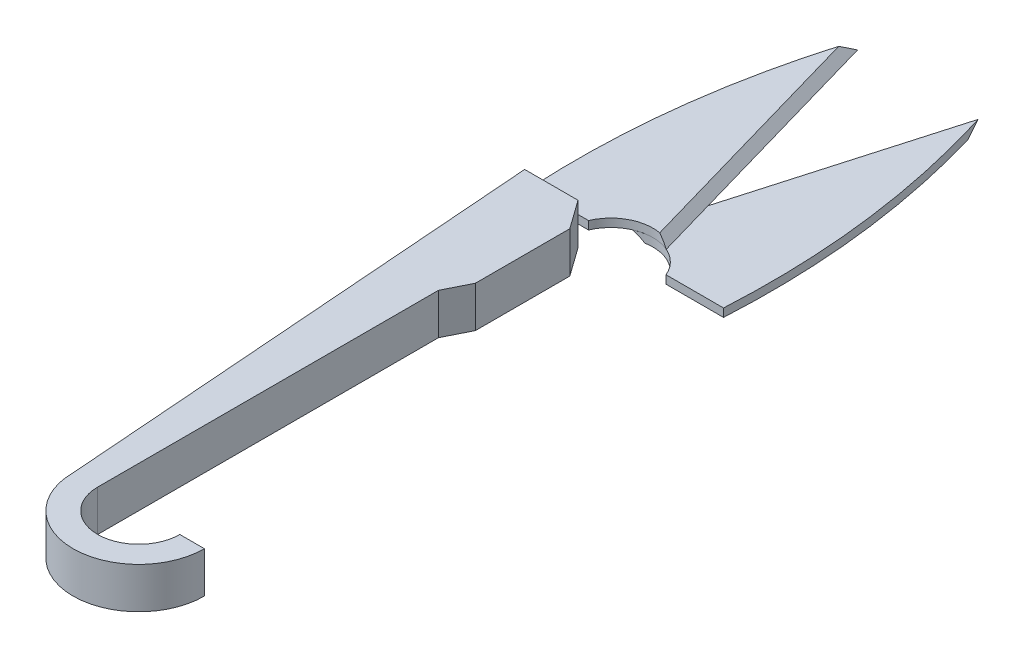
ISO-10303-21;
HEADER;
FILE_DESCRIPTION(('STEP AP214'),'2;1');
FILE_NAME('part.step','',(''),(''),'','','');
FILE_SCHEMA(('AUTOMOTIVE_DESIGN { 1 0 10303 214 1 1 1 1 }'));
ENDSEC;
DATA;
#1=APPLICATION_CONTEXT('core data for automotive mechanical design processes');
#2=APPLICATION_PROTOCOL_DEFINITION('international standard','automotive_design',2000,#1);
#3=PRODUCT_CONTEXT('',#1,'mechanical');
#4=PRODUCT('Part','Part','',(#3));
#5=PRODUCT_RELATED_PRODUCT_CATEGORY('part','',(#4));
#6=PRODUCT_DEFINITION_FORMATION('','',#4);
#7=PRODUCT_DEFINITION_CONTEXT('part definition',#1,'design');
#8=PRODUCT_DEFINITION('design','',#6,#7);
#9=PRODUCT_DEFINITION_SHAPE('','',#8);
#10=(LENGTH_UNIT() NAMED_UNIT(*) SI_UNIT(.MILLI.,.METRE.));
#11=(NAMED_UNIT(*) PLANE_ANGLE_UNIT() SI_UNIT($,.RADIAN.));
#12=(NAMED_UNIT(*) SI_UNIT($,.STERADIAN.) SOLID_ANGLE_UNIT());
#13=UNCERTAINTY_MEASURE_WITH_UNIT(LENGTH_MEASURE(1.E-05),#10,'distance_accuracy_value','');
#14=(GEOMETRIC_REPRESENTATION_CONTEXT(3) GLOBAL_UNCERTAINTY_ASSIGNED_CONTEXT((#13)) GLOBAL_UNIT_ASSIGNED_CONTEXT((#10,
#11,#12)) REPRESENTATION_CONTEXT('',''));
#15=CARTESIAN_POINT('',(0.,0.,0.));
#16=DIRECTION('',(0.,0.,1.));
#17=DIRECTION('',(1.,0.,0.));
#18=AXIS2_PLACEMENT_3D('',#15,#16,#17);
#19=CARTESIAN_POINT('',(0.,-1.,-15.));
#20=DIRECTION('',(0.,0.,-1.));
#21=DIRECTION('',(-1.,0.,0.));
#22=AXIS2_PLACEMENT_3D('',#19,#20,#21);
#23=PLANE('',#22);
#24=DIRECTION('',(-1.,0.,0.));
#25=VECTOR('',#24,1.);
#26=CARTESIAN_POINT('',(0.,0.,-15.));
#27=LINE('',#26,#25);
#28=CARTESIAN_POINT('',(11.7186421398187,0.,-15.));
#29=VERTEX_POINT('',#28);
#30=CARTESIAN_POINT('',(4.71864213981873,0.,-15.));
#31=VERTEX_POINT('',#30);
#32=EDGE_CURVE('E150',#29,#31,#27,.T.);
#33=ORIENTED_EDGE('',*,*,#32,.T.);
#34=DIRECTION('',(0.,1.,0.));
#35=VECTOR('',#34,1.);
#36=CARTESIAN_POINT('',(4.71864213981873,-1.,-15.));
#37=LINE('',#36,#35);
#38=CARTESIAN_POINT('',(4.71864213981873,-1.,-15.));
#39=VERTEX_POINT('',#38);
#40=EDGE_CURVE('E112',#39,#31,#37,.T.);
#41=ORIENTED_EDGE('',*,*,#40,.F.);
#42=DIRECTION('',(-1.,0.,0.));
#43=VECTOR('',#42,1.);
#44=CARTESIAN_POINT('',(0.,-1.,-15.));
#45=LINE('',#44,#43);
#46=CARTESIAN_POINT('',(11.7186421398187,-1.,-15.));
#47=VERTEX_POINT('',#46);
#48=EDGE_CURVE('E117',#47,#39,#45,.T.);
#49=ORIENTED_EDGE('',*,*,#48,.F.);
#50=DIRECTION('',(0.,1.,0.));
#51=VECTOR('',#50,1.);
#52=CARTESIAN_POINT('',(11.7186421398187,-1.,-15.));
#53=LINE('',#52,#51);
#54=EDGE_CURVE('E102',#47,#29,#53,.T.);
#55=ORIENTED_EDGE('',*,*,#54,.T.);
#56=EDGE_LOOP('',(#33,#41,#49,#55));
#57=FACE_BOUND('',#56,.T.);
#58=ADVANCED_FACE('F56',(#57),#23,.F.);
#59=CARTESIAN_POINT('',(0.,-1.,-13.));
#60=DIRECTION('',(0.,1.,0.));
#61=DIRECTION('',(0.,0.,1.));
#62=AXIS2_PLACEMENT_3D('',#59,#60,#61);
#63=CYLINDRICAL_SURFACE('',#62,5.1249959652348);
#64=CARTESIAN_POINT('',(0.,0.,-13.));
#65=DIRECTION('',(0.,1.,0.));
#66=DIRECTION('',(0.,0.,1.));
#67=AXIS2_PLACEMENT_3D('',#64,#65,#66);
#68=CIRCLE('',#67,5.1249959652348);
#69=CARTESIAN_POINT('',(-2.04821488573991,0.,-17.6979143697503));
#70=VERTEX_POINT('',#69);
#71=EDGE_CURVE('E119',#31,#70,#68,.T.);
#72=ORIENTED_EDGE('',*,*,#71,.T.);
#73=CARTESIAN_POINT('',(0.,-3.26458401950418,-13.));
#74=DIRECTION('',(-0.67967554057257,-0.707106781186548,-0.195041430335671));
#75=DIRECTION('',(-0.679675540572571,0.707106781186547,-0.195041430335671));
#76=AXIS2_PLACEMENT_3D('',#73,#74,#75);
#77=ELLIPSE('',#76,7.24783880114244,5.1249959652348);
#78=CARTESIAN_POINT('',(-0.908595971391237,-1.,-18.0438117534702));
#79=VERTEX_POINT('',#78);
#80=EDGE_CURVE('E85',#70,#79,#77,.T.);
#81=ORIENTED_EDGE('',*,*,#80,.T.);
#82=CARTESIAN_POINT('',(0.,-1.,-13.));
#83=DIRECTION('',(0.,1.,0.));
#84=DIRECTION('',(0.,0.,1.));
#85=AXIS2_PLACEMENT_3D('',#82,#83,#84);
#86=CIRCLE('',#85,5.1249959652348);
#87=EDGE_CURVE('E113',#39,#79,#86,.T.);
#88=ORIENTED_EDGE('',*,*,#87,.F.);
#89=ORIENTED_EDGE('',*,*,#40,.T.);
#90=EDGE_LOOP('',(#72,#81,#88,#89));
#91=FACE_BOUND('',#90,.T.);
#92=ADVANCED_FACE('F134',(#91),#63,.F.);
#93=CARTESIAN_POINT('',(11.7186421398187,-1.,-15.));
#94=CARTESIAN_POINT('',(12.7251725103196,-1.,-33.0616488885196));
#95=CARTESIAN_POINT('',(7.33022859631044,-1.,-50.3796816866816));
#96=B_SPLINE_CURVE_WITH_KNOTS('',2,(#93,#94,#95),.UNSPECIFIED.,.F.,.F.,(3,3),(0.,1.),.UNSPECIFIED.);
#97=DIRECTION('',(0.,1.,0.));
#98=VECTOR('',#97,1.);
#99=SURFACE_OF_LINEAR_EXTRUSION('',#96,#98);
#100=CARTESIAN_POINT('',(7.86349357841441,-1.,-48.6125719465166));
#101=VERTEX_POINT('',#100);
#102=EDGE_CURVE('E105',#47,#101,#96,.T.);
#103=ORIENTED_EDGE('',*,*,#102,.T.);
#104=CARTESIAN_POINT('',(7.86349358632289,-1.,-48.6125719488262));
#105=CARTESIAN_POINT('',(7.77696561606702,-0.835117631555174,-48.908808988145));
#106=CARTESIAN_POINT('',(7.68926288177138,-0.669343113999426,-49.2041866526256));
#107=CARTESIAN_POINT('',(7.51150788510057,-0.33600978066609,-49.7932232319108));
#108=CARTESIAN_POINT('',(7.42145562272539,-0.168450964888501,-50.0868821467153));
#109=CARTESIAN_POINT('',(7.33022859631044,0.,-50.3796816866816));
#110=B_SPLINE_CURVE_WITH_KNOTS('',3,(#104,#105,#106,#107,#108,#109),.UNSPECIFIED.,.F.,.F.,(4,2,
4),(0.,1.04966105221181,2.09932210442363),.UNSPECIFIED.);
#111=CARTESIAN_POINT('',(7.33022859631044,0.,-50.3796816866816));
#112=VERTEX_POINT('',#111);
#113=EDGE_CURVE('E12',#101,#112,#110,.T.);
#114=ORIENTED_EDGE('',*,*,#113,.T.);
#115=CARTESIAN_POINT('',(11.7186421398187,0.,-15.));
#116=CARTESIAN_POINT('',(12.7251725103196,0.,-33.0616488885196));
#117=CARTESIAN_POINT('',(7.33022859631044,0.,-50.3796816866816));
#118=B_SPLINE_CURVE_WITH_KNOTS('',2,(#115,#116,#117),.UNSPECIFIED.,.F.,.F.,(3,3),(0.,1.),.UNSPECIFIED.);
#119=EDGE_CURVE('E108',#29,#112,#118,.T.);
#120=ORIENTED_EDGE('',*,*,#119,.F.);
#121=ORIENTED_EDGE('',*,*,#54,.F.);
#122=EDGE_LOOP('',(#103,#114,#120,#121));
#123=FACE_BOUND('',#122,.T.);
#124=ADVANCED_FACE('F104',(#123),#99,.T.);
#125=CARTESIAN_POINT('',(0.,-1.,0.));
#126=DIRECTION('',(0.,1.,0.));
#127=DIRECTION('',(0.,0.,1.));
#128=AXIS2_PLACEMENT_3D('',#125,#126,#127);
#129=PLANE('',#128);
#130=ORIENTED_EDGE('',*,*,#87,.T.);
#131=DIRECTION('',(0.275830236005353,0.,-0.961206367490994));
#132=VECTOR('',#131,1.);
#133=CARTESIAN_POINT('',(8.29143496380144,-1.,-50.1038514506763));
#134=LINE('',#133,#132);
#135=EDGE_CURVE('E71',#79,#101,#134,.T.);
#136=ORIENTED_EDGE('',*,*,#135,.T.);
#137=ORIENTED_EDGE('',*,*,#102,.F.);
#138=ORIENTED_EDGE('',*,*,#48,.T.);
#139=EDGE_LOOP('',(#130,#136,#137,#138));
#140=FACE_BOUND('',#139,.T.);
#141=ADVANCED_FACE('F121',(#140),#129,.F.);
#142=CARTESIAN_POINT('',(0.,0.,0.));
#143=DIRECTION('',(0.,1.,0.));
#144=DIRECTION('',(0.,0.,1.));
#145=AXIS2_PLACEMENT_3D('',#142,#143,#144);
#146=PLANE('',#145);
#147=ORIENTED_EDGE('',*,*,#32,.F.);
#148=ORIENTED_EDGE('',*,*,#119,.T.);
#149=DIRECTION('',(-0.275830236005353,0.,0.961206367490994));
#150=VECTOR('',#149,1.);
#151=CARTESIAN_POINT('',(-6.58462607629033,0.,-1.88954112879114));
#152=LINE('',#151,#150);
#153=EDGE_CURVE('E144',#112,#70,#152,.T.);
#154=ORIENTED_EDGE('',*,*,#153,.T.);
#155=ORIENTED_EDGE('',*,*,#71,.F.);
#156=EDGE_LOOP('',(#147,#148,#154,#155));
#157=FACE_BOUND('',#156,.T.);
#158=ADVANCED_FACE('F147',(#157),#146,.T.);
#159=CARTESIAN_POINT('',(-6.58462607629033,0.,-1.88954112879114));
#160=DIRECTION('',(-0.67967554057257,-0.707106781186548,-0.195041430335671));
#161=DIRECTION('',(0.275830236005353,0.,-0.961206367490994));
#162=AXIS2_PLACEMENT_3D('',#159,#160,#161);
#163=PLANE('',#162);
#164=ORIENTED_EDGE('',*,*,#113,.F.);
#165=ORIENTED_EDGE('',*,*,#135,.F.);
#166=ORIENTED_EDGE('',*,*,#80,.F.);
#167=ORIENTED_EDGE('',*,*,#153,.F.);
#168=EDGE_LOOP('',(#164,#165,#166,#167));
#169=FACE_BOUND('',#168,.T.);
#170=ADVANCED_FACE('F59',(#169),#163,.T.);
#171=CLOSED_SHELL('',(#58,#92,#124,#141,#158,#170));
#172=MANIFOLD_SOLID_BREP('B2_NOT_SHOWN',#171);
#173=CARTESIAN_POINT('',(-11.7186421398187,1.,-15.));
#174=CARTESIAN_POINT('',(-12.7251725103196,1.,-33.0616488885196));
#175=CARTESIAN_POINT('',(-7.33022859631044,1.,-50.3796816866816));
#176=B_SPLINE_CURVE_WITH_KNOTS('',2,(#173,#174,#175),.UNSPECIFIED.,.F.,.F.,(3,3),(0.,1.),.UNSPECIFIED.);
#177=DIRECTION('',(0.,-1.,0.));
#178=VECTOR('',#177,1.);
#179=SURFACE_OF_LINEAR_EXTRUSION('',#176,#178);
#180=CARTESIAN_POINT('',(-11.7186421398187,1.,-15.));
#181=VERTEX_POINT('',#180);
#182=CARTESIAN_POINT('',(-7.86349357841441,1.,-48.6125719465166));
#183=VERTEX_POINT('',#182);
#184=EDGE_CURVE('E262',#181,#183,#176,.T.);
#185=ORIENTED_EDGE('',*,*,#184,.T.);
#186=CARTESIAN_POINT('',(-7.86349358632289,1.,-48.6125719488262));
#187=CARTESIAN_POINT('',(-7.77696561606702,0.835117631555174,-48.908808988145));
#188=CARTESIAN_POINT('',(-7.68926288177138,0.669343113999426,-49.2041866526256));
#189=CARTESIAN_POINT('',(-7.51150788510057,0.33600978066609,-49.7932232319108));
#190=CARTESIAN_POINT('',(-7.42145562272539,0.168450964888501,-50.0868821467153));
#191=CARTESIAN_POINT('',(-7.33022859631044,0.,-50.3796816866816));
#192=B_SPLINE_CURVE_WITH_KNOTS('',3,(#186,#187,#188,#189,#190,#191),.UNSPECIFIED.,.F.,.F.,(4,2,
4),(0.,1.04966105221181,2.09932210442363),.UNSPECIFIED.);
#193=CARTESIAN_POINT('',(-7.33022859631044,0.,-50.3796816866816));
#194=VERTEX_POINT('',#193);
#195=EDGE_CURVE('E54',#183,#194,#192,.T.);
#196=ORIENTED_EDGE('',*,*,#195,.T.);
#197=CARTESIAN_POINT('',(-11.7186421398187,0.,-15.));
#198=CARTESIAN_POINT('',(-12.7251725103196,0.,-33.0616488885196));
#199=CARTESIAN_POINT('',(-7.33022859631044,0.,-50.3796816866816));
#200=B_SPLINE_CURVE_WITH_KNOTS('',2,(#197,#198,#199),.UNSPECIFIED.,.F.,.F.,(3,3),(0.,1.),.UNSPECIFIED.);
#201=CARTESIAN_POINT('',(-11.7186421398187,0.,-15.));
#202=VERTEX_POINT('',#201);
#203=EDGE_CURVE('E265',#202,#194,#200,.T.);
#204=ORIENTED_EDGE('',*,*,#203,.F.);
#205=DIRECTION('',(0.,-1.,0.));
#206=VECTOR('',#205,1.);
#207=CARTESIAN_POINT('',(-11.7186421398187,1.,-15.));
#208=LINE('',#207,#206);
#209=EDGE_CURVE('E260',#181,#202,#208,.T.);
#210=ORIENTED_EDGE('',*,*,#209,.F.);
#211=EDGE_LOOP('',(#185,#196,#204,#210));
#212=FACE_BOUND('',#211,.T.);
#213=ADVANCED_FACE('F215',(#212),#179,.T.);
#214=CARTESIAN_POINT('',(0.,1.,-15.));
#215=DIRECTION('',(0.,0.,-1.));
#216=DIRECTION('',(-1.,0.,0.));
#217=AXIS2_PLACEMENT_3D('',#214,#215,#216);
#218=PLANE('',#217);
#219=DIRECTION('',(1.,0.,0.));
#220=VECTOR('',#219,1.);
#221=CARTESIAN_POINT('',(0.,0.,-15.));
#222=LINE('',#221,#220);
#223=CARTESIAN_POINT('',(-4.71864213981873,0.,-15.));
#224=VERTEX_POINT('',#223);
#225=EDGE_CURVE('E349',#202,#224,#222,.T.);
#226=ORIENTED_EDGE('',*,*,#225,.T.);
#227=DIRECTION('',(0.,-1.,0.));
#228=VECTOR('',#227,1.);
#229=CARTESIAN_POINT('',(-4.71864213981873,1.,-15.));
#230=LINE('',#229,#228);
#231=CARTESIAN_POINT('',(-4.71864213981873,1.,-15.));
#232=VERTEX_POINT('',#231);
#233=EDGE_CURVE('E269',#232,#224,#230,.T.);
#234=ORIENTED_EDGE('',*,*,#233,.F.);
#235=DIRECTION('',(1.,0.,0.));
#236=VECTOR('',#235,1.);
#237=CARTESIAN_POINT('',(0.,1.,-15.));
#238=LINE('',#237,#236);
#239=EDGE_CURVE('E273',#181,#232,#238,.T.);
#240=ORIENTED_EDGE('',*,*,#239,.F.);
#241=ORIENTED_EDGE('',*,*,#209,.T.);
#242=EDGE_LOOP('',(#226,#234,#240,#241));
#243=FACE_BOUND('',#242,.T.);
#244=ADVANCED_FACE('F274',(#243),#218,.F.);
#245=CARTESIAN_POINT('',(0.,1.,-13.));
#246=DIRECTION('',(0.,-1.,0.));
#247=DIRECTION('',(0.,0.,-1.));
#248=AXIS2_PLACEMENT_3D('',#245,#246,#247);
#249=CYLINDRICAL_SURFACE('',#248,5.1249959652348);
#250=CARTESIAN_POINT('',(0.,0.,-13.));
#251=DIRECTION('',(0.,1.,0.));
#252=DIRECTION('',(0.,0.,1.));
#253=AXIS2_PLACEMENT_3D('',#250,#251,#252);
#254=CIRCLE('',#253,5.1249959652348);
#255=CARTESIAN_POINT('',(2.04821488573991,0.,-17.6979143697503));
#256=VERTEX_POINT('',#255);
#257=EDGE_CURVE('E281',#256,#224,#254,.T.);
#258=ORIENTED_EDGE('',*,*,#257,.F.);
#259=CARTESIAN_POINT('',(0.,3.2645840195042,-13.));
#260=DIRECTION('',(-0.67967554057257,-0.707106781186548,0.195041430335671));
#261=DIRECTION('',(0.679675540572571,-0.707106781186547,-0.195041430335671));
#262=AXIS2_PLACEMENT_3D('',#259,#260,#261);
#263=ELLIPSE('',#262,7.24783880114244,5.1249959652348);
#264=CARTESIAN_POINT('',(0.90859597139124,1.,-18.0438117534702));
#265=VERTEX_POINT('',#264);
#266=EDGE_CURVE('E243',#256,#265,#263,.F.);
#267=ORIENTED_EDGE('',*,*,#266,.T.);
#268=CARTESIAN_POINT('',(0.,1.,-13.));
#269=DIRECTION('',(0.,1.,0.));
#270=DIRECTION('',(0.,0.,1.));
#271=AXIS2_PLACEMENT_3D('',#268,#269,#270);
#272=CIRCLE('',#271,5.1249959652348);
#273=EDGE_CURVE('E275',#265,#232,#272,.T.);
#274=ORIENTED_EDGE('',*,*,#273,.T.);
#275=ORIENTED_EDGE('',*,*,#233,.T.);
#276=EDGE_LOOP('',(#258,#267,#274,#275));
#277=FACE_BOUND('',#276,.T.);
#278=ADVANCED_FACE('F295',(#277),#249,.F.);
#279=CARTESIAN_POINT('',(0.,1.,0.));
#280=DIRECTION('',(0.,1.,0.));
#281=DIRECTION('',(0.,0.,1.));
#282=AXIS2_PLACEMENT_3D('',#279,#280,#281);
#283=PLANE('',#282);
#284=ORIENTED_EDGE('',*,*,#273,.F.);
#285=DIRECTION('',(-0.275830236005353,0.,-0.961206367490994));
#286=VECTOR('',#285,1.);
#287=CARTESIAN_POINT('',(5.62341970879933,1.,-1.61371089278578));
#288=LINE('',#287,#286);
#289=EDGE_CURVE('E229',#265,#183,#288,.T.);
#290=ORIENTED_EDGE('',*,*,#289,.T.);
#291=ORIENTED_EDGE('',*,*,#184,.F.);
#292=ORIENTED_EDGE('',*,*,#239,.T.);
#293=EDGE_LOOP('',(#284,#290,#291,#292));
#294=FACE_BOUND('',#293,.T.);
#295=ADVANCED_FACE('F277',(#294),#283,.T.);
#296=CARTESIAN_POINT('',(0.,0.,0.));
#297=DIRECTION('',(0.,1.,0.));
#298=DIRECTION('',(0.,0.,1.));
#299=AXIS2_PLACEMENT_3D('',#296,#297,#298);
#300=PLANE('',#299);
#301=ORIENTED_EDGE('',*,*,#203,.T.);
#302=DIRECTION('',(0.275830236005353,0.,0.961206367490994));
#303=VECTOR('',#302,1.);
#304=CARTESIAN_POINT('',(6.58462607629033,0.,-1.88954112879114));
#305=LINE('',#304,#303);
#306=EDGE_CURVE('E278',#194,#256,#305,.T.);
#307=ORIENTED_EDGE('',*,*,#306,.T.);
#308=ORIENTED_EDGE('',*,*,#257,.T.);
#309=ORIENTED_EDGE('',*,*,#225,.F.);
#310=EDGE_LOOP('',(#301,#307,#308,#309));
#311=FACE_BOUND('',#310,.T.);
#312=ADVANCED_FACE('F298',(#311),#300,.F.);
#313=CARTESIAN_POINT('',(6.58462607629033,0.,-1.88954112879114));
#314=DIRECTION('',(-0.67967554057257,-0.707106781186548,0.195041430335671));
#315=DIRECTION('',(0.275830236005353,0.,0.961206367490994));
#316=AXIS2_PLACEMENT_3D('',#313,#314,#315);
#317=PLANE('',#316);
#318=ORIENTED_EDGE('',*,*,#195,.F.);
#319=ORIENTED_EDGE('',*,*,#289,.F.);
#320=ORIENTED_EDGE('',*,*,#266,.F.);
#321=ORIENTED_EDGE('',*,*,#306,.F.);
#322=EDGE_LOOP('',(#318,#319,#320,#321));
#323=FACE_BOUND('',#322,.T.);
#324=ADVANCED_FACE('F218',(#323),#317,.F.);
#325=CLOSED_SHELL('',(#213,#244,#278,#295,#312,#324));
#326=MANIFOLD_SOLID_BREP('B6',#325);
#327=CARTESIAN_POINT('',(-11.3009057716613,2.5,0.854690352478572));
#328=DIRECTION('',(0.997152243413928,0.,-0.0754148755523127));
#329=DIRECTION('',(-0.0754148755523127,0.,-0.997152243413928));
#330=AXIS2_PLACEMENT_3D('',#327,#328,#329);
#331=PLANE('',#330);
#332=DIRECTION('',(0.0754148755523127,0.,0.997152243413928));
#333=VECTOR('',#332,1.);
#334=CARTESIAN_POINT('',(-11.3009057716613,-2.5,0.854690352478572));
#335=LINE('',#334,#333);
#336=CARTESIAN_POINT('',(-12.5,-2.5,-15.));
#337=VERTEX_POINT('',#336);
#338=CARTESIAN_POINT('',(-8.00000000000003,-2.5,44.5));
#339=VERTEX_POINT('',#338);
#340=EDGE_CURVE('E468',#337,#339,#335,.T.);
#341=ORIENTED_EDGE('',*,*,#340,.T.);
#342=DIRECTION('',(0.,-1.,0.));
#343=VECTOR('',#342,1.);
#344=CARTESIAN_POINT('',(-8.00000000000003,2.5,44.5));
#345=LINE('',#344,#343);
#346=CARTESIAN_POINT('',(-8.00000000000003,2.5,44.5));
#347=VERTEX_POINT('',#346);
#348=EDGE_CURVE('E213',#347,#339,#345,.T.);
#349=ORIENTED_EDGE('',*,*,#348,.F.);
#350=DIRECTION('',(0.0754148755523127,0.,0.997152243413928));
#351=VECTOR('',#350,1.);
#352=CARTESIAN_POINT('',(-11.3009057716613,2.5,0.854690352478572));
#353=LINE('',#352,#351);
#354=CARTESIAN_POINT('',(-12.5,2.5,-15.));
#355=VERTEX_POINT('',#354);
#356=EDGE_CURVE('E491',#355,#347,#353,.T.);
#357=ORIENTED_EDGE('',*,*,#356,.F.);
#358=DIRECTION('',(0.,-1.,0.));
#359=VECTOR('',#358,1.);
#360=CARTESIAN_POINT('',(-12.5,2.5,-15.));
#361=LINE('',#360,#359);
#362=EDGE_CURVE('E381',#355,#337,#361,.T.);
#363=ORIENTED_EDGE('',*,*,#362,.T.);
#364=EDGE_LOOP('',(#341,#349,#357,#363));
#365=FACE_BOUND('',#364,.T.);
#366=ADVANCED_FACE('F365',(#365),#331,.F.);
#367=CARTESIAN_POINT('',(0.,2.5,44.5));
#368=DIRECTION('',(0.,-1.,0.));
#369=DIRECTION('',(0.,0.,-1.));
#370=AXIS2_PLACEMENT_3D('',#367,#368,#369);
#371=CYLINDRICAL_SURFACE('',#370,8.);
#372=CARTESIAN_POINT('',(0.,-2.5,44.5));
#373=DIRECTION('',(0.,1.,0.));
#374=DIRECTION('',(0.,0.,1.));
#375=AXIS2_PLACEMENT_3D('',#372,#373,#374);
#376=CIRCLE('',#375,8.);
#377=CARTESIAN_POINT('',(7.99999999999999,-2.5,44.5));
#378=VERTEX_POINT('',#377);
#379=EDGE_CURVE('E470',#339,#378,#376,.T.);
#380=ORIENTED_EDGE('',*,*,#379,.T.);
#381=DIRECTION('',(0.,-1.,0.));
#382=VECTOR('',#381,1.);
#383=CARTESIAN_POINT('',(7.99999999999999,2.5,44.5));
#384=LINE('',#383,#382);
#385=CARTESIAN_POINT('',(7.99999999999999,2.5,44.5));
#386=VERTEX_POINT('',#385);
#387=EDGE_CURVE('E373',#386,#378,#384,.T.);
#388=ORIENTED_EDGE('',*,*,#387,.F.);
#389=CARTESIAN_POINT('',(0.,2.5,44.5));
#390=DIRECTION('',(0.,1.,0.));
#391=DIRECTION('',(0.,0.,1.));
#392=AXIS2_PLACEMENT_3D('',#389,#390,#391);
#393=CIRCLE('',#392,8.);
#394=EDGE_CURVE('E422',#347,#386,#393,.T.);
#395=ORIENTED_EDGE('',*,*,#394,.F.);
#396=ORIENTED_EDGE('',*,*,#348,.T.);
#397=EDGE_LOOP('',(#380,#388,#395,#396));
#398=FACE_BOUND('',#397,.T.);
#399=ADVANCED_FACE('F506',(#398),#371,.T.);
#400=CARTESIAN_POINT('',(0.,2.5,44.5));
#401=DIRECTION('',(0.,0.,-1.));
#402=DIRECTION('',(-1.,0.,0.));
#403=AXIS2_PLACEMENT_3D('',#400,#401,#402);
#404=PLANE('',#403);
#405=DIRECTION('',(1.,0.,0.));
#406=VECTOR('',#405,1.);
#407=CARTESIAN_POINT('',(0.,-2.5,44.5));
#408=LINE('',#407,#406);
#409=CARTESIAN_POINT('',(5.00000000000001,-2.5,44.5));
#410=VERTEX_POINT('',#409);
#411=EDGE_CURVE('E473',#410,#378,#408,.T.);
#412=ORIENTED_EDGE('',*,*,#411,.F.);
#413=DIRECTION('',(0.,-1.,0.));
#414=VECTOR('',#413,1.);
#415=CARTESIAN_POINT('',(5.00000000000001,2.5,44.5));
#416=LINE('',#415,#414);
#417=CARTESIAN_POINT('',(5.00000000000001,2.5,44.5));
#418=VERTEX_POINT('',#417);
#419=EDGE_CURVE('E499',#418,#410,#416,.T.);
#420=ORIENTED_EDGE('',*,*,#419,.F.);
#421=DIRECTION('',(1.,0.,0.));
#422=VECTOR('',#421,1.);
#423=CARTESIAN_POINT('',(0.,2.5,44.5));
#424=LINE('',#423,#422);
#425=EDGE_CURVE('E505',#418,#386,#424,.T.);
#426=ORIENTED_EDGE('',*,*,#425,.T.);
#427=ORIENTED_EDGE('',*,*,#387,.T.);
#428=EDGE_LOOP('',(#412,#420,#426,#427));
#429=FACE_BOUND('',#428,.T.);
#430=ADVANCED_FACE('F503',(#429),#404,.T.);
#431=CARTESIAN_POINT('',(0.,2.5,44.5));
#432=DIRECTION('',(0.,-1.,0.));
#433=DIRECTION('',(0.,0.,-1.));
#434=AXIS2_PLACEMENT_3D('',#431,#432,#433);
#435=CYLINDRICAL_SURFACE('',#434,5.);
#436=CARTESIAN_POINT('',(0.,-2.5,44.5));
#437=DIRECTION('',(0.,1.,0.));
#438=DIRECTION('',(0.,0.,1.));
#439=AXIS2_PLACEMENT_3D('',#436,#437,#438);
#440=CIRCLE('',#439,5.);
#441=CARTESIAN_POINT('',(-5.0000000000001,-2.5,44.5));
#442=VERTEX_POINT('',#441);
#443=EDGE_CURVE('E476',#442,#410,#440,.T.);
#444=ORIENTED_EDGE('',*,*,#443,.F.);
#445=DIRECTION('',(0.,-1.,0.));
#446=VECTOR('',#445,1.);
#447=CARTESIAN_POINT('',(-5.0000000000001,2.5,44.5));
#448=LINE('',#447,#446);
#449=CARTESIAN_POINT('',(-5.0000000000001,2.5,44.5));
#450=VERTEX_POINT('',#449);
#451=EDGE_CURVE('E497',#450,#442,#448,.T.);
#452=ORIENTED_EDGE('',*,*,#451,.F.);
#453=CARTESIAN_POINT('',(0.,2.5,44.5));
#454=DIRECTION('',(0.,1.,0.));
#455=DIRECTION('',(0.,0.,1.));
#456=AXIS2_PLACEMENT_3D('',#453,#454,#455);
#457=CIRCLE('',#456,5.);
#458=EDGE_CURVE('E516',#450,#418,#457,.T.);
#459=ORIENTED_EDGE('',*,*,#458,.T.);
#460=ORIENTED_EDGE('',*,*,#419,.T.);
#461=EDGE_LOOP('',(#444,#452,#459,#460));
#462=FACE_BOUND('',#461,.T.);
#463=ADVANCED_FACE('F513',(#462),#435,.F.);
#464=CARTESIAN_POINT('',(-4.99999999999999,2.5,0.));
#465=DIRECTION('',(1.,0.,0.));
#466=DIRECTION('',(0.,0.,-1.));
#467=AXIS2_PLACEMENT_3D('',#464,#465,#466);
#468=PLANE('',#467);
#469=DIRECTION('',(0.,0.,1.));
#470=VECTOR('',#469,1.);
#471=CARTESIAN_POINT('',(-4.99999999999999,-2.5,0.));
#472=LINE('',#471,#470);
#473=CARTESIAN_POINT('',(-4.99999999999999,-2.5,3.00000000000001));
#474=VERTEX_POINT('',#473);
#475=EDGE_CURVE('E479',#474,#442,#472,.T.);
#476=ORIENTED_EDGE('',*,*,#475,.F.);
#477=DIRECTION('',(0.,-1.,0.));
#478=VECTOR('',#477,1.);
#479=CARTESIAN_POINT('',(-4.99999999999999,2.5,3.00000000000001));
#480=LINE('',#479,#478);
#481=CARTESIAN_POINT('',(-4.99999999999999,2.5,3.00000000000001));
#482=VERTEX_POINT('',#481);
#483=EDGE_CURVE('E495',#482,#474,#480,.T.);
#484=ORIENTED_EDGE('',*,*,#483,.F.);
#485=DIRECTION('',(0.,0.,1.));
#486=VECTOR('',#485,1.);
#487=CARTESIAN_POINT('',(-4.99999999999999,2.5,0.));
#488=LINE('',#487,#486);
#489=EDGE_CURVE('E519',#482,#450,#488,.T.);
#490=ORIENTED_EDGE('',*,*,#489,.T.);
#491=ORIENTED_EDGE('',*,*,#451,.T.);
#492=EDGE_LOOP('',(#476,#484,#490,#491));
#493=FACE_BOUND('',#492,.T.);
#494=ADVANCED_FACE('F548',(#493),#468,.T.);
#495=CARTESIAN_POINT('',(-2.8,2.5,-1.4));
#496=DIRECTION('',(0.894427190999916,0.,0.447213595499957));
#497=DIRECTION('',(0.447213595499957,0.,-0.894427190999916));
#498=AXIS2_PLACEMENT_3D('',#495,#496,#497);
#499=PLANE('',#498);
#500=DIRECTION('',(-0.447213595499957,0.,0.894427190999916));
#501=VECTOR('',#500,1.);
#502=CARTESIAN_POINT('',(-2.8,-2.5,-1.4));
#503=LINE('',#502,#501);
#504=CARTESIAN_POINT('',(-3.5,-2.5,0.));
#505=VERTEX_POINT('',#504);
#506=EDGE_CURVE('E482',#505,#474,#503,.T.);
#507=ORIENTED_EDGE('',*,*,#506,.F.);
#508=DIRECTION('',(0.,-1.,0.));
#509=VECTOR('',#508,1.);
#510=CARTESIAN_POINT('',(-3.5,2.5,0.));
#511=LINE('',#510,#509);
#512=CARTESIAN_POINT('',(-3.5,2.5,0.));
#513=VERTEX_POINT('',#512);
#514=EDGE_CURVE('E450',#513,#505,#511,.T.);
#515=ORIENTED_EDGE('',*,*,#514,.F.);
#516=DIRECTION('',(-0.447213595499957,0.,0.894427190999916));
#517=VECTOR('',#516,1.);
#518=CARTESIAN_POINT('',(-2.8,2.5,-1.4));
#519=LINE('',#518,#517);
#520=EDGE_CURVE('E460',#513,#482,#519,.T.);
#521=ORIENTED_EDGE('',*,*,#520,.T.);
#522=ORIENTED_EDGE('',*,*,#483,.T.);
#523=EDGE_LOOP('',(#507,#515,#521,#522));
#524=FACE_BOUND('',#523,.T.);
#525=ADVANCED_FACE('F526',(#524),#499,.T.);
#526=CARTESIAN_POINT('',(-3.5,2.5,0.));
#527=DIRECTION('',(1.,0.,0.));
#528=DIRECTION('',(0.,0.,-1.));
#529=AXIS2_PLACEMENT_3D('',#526,#527,#528);
#530=PLANE('',#529);
#531=DIRECTION('',(0.,0.,1.));
#532=VECTOR('',#531,1.);
#533=CARTESIAN_POINT('',(-3.5,-2.5,0.));
#534=LINE('',#533,#532);
#535=CARTESIAN_POINT('',(-3.5,-2.5,-11.5));
#536=VERTEX_POINT('',#535);
#537=EDGE_CURVE('E446',#536,#505,#534,.T.);
#538=ORIENTED_EDGE('',*,*,#537,.F.);
#539=DIRECTION('',(0.,-1.,0.));
#540=VECTOR('',#539,1.);
#541=CARTESIAN_POINT('',(-3.5,2.5,-11.5));
#542=LINE('',#541,#540);
#543=CARTESIAN_POINT('',(-3.5,2.5,-11.5));
#544=VERTEX_POINT('',#543);
#545=EDGE_CURVE('E441',#544,#536,#542,.T.);
#546=ORIENTED_EDGE('',*,*,#545,.F.);
#547=DIRECTION('',(0.,0.,1.));
#548=VECTOR('',#547,1.);
#549=CARTESIAN_POINT('',(-3.5,2.5,0.));
#550=LINE('',#549,#548);
#551=EDGE_CURVE('E444',#544,#513,#550,.T.);
#552=ORIENTED_EDGE('',*,*,#551,.T.);
#553=ORIENTED_EDGE('',*,*,#514,.T.);
#554=EDGE_LOOP('',(#538,#546,#552,#553));
#555=FACE_BOUND('',#554,.T.);
#556=ADVANCED_FACE('F443',(#555),#530,.T.);
#557=CARTESIAN_POINT('',(3.12162162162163,2.5,-2.22972972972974));
#558=DIRECTION('',(0.813733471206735,0.,-0.581238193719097));
#559=DIRECTION('',(-0.581238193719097,0.,-0.813733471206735));
#560=AXIS2_PLACEMENT_3D('',#557,#558,#559);
#561=PLANE('',#560);
#562=DIRECTION('',(0.581238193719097,0.,0.813733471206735));
#563=VECTOR('',#562,1.);
#564=CARTESIAN_POINT('',(3.12162162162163,-2.5,-2.22972972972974));
#565=LINE('',#564,#563);
#566=CARTESIAN_POINT('',(-6.,-2.5,-15.));
#567=VERTEX_POINT('',#566);
#568=EDGE_CURVE('E486',#567,#536,#565,.T.);
#569=ORIENTED_EDGE('',*,*,#568,.F.);
#570=DIRECTION('',(0.,-1.,0.));
#571=VECTOR('',#570,1.);
#572=CARTESIAN_POINT('',(-6.,2.5,-15.));
#573=LINE('',#572,#571);
#574=CARTESIAN_POINT('',(-6.,2.5,-15.));
#575=VERTEX_POINT('',#574);
#576=EDGE_CURVE('E410',#575,#567,#573,.T.);
#577=ORIENTED_EDGE('',*,*,#576,.F.);
#578=DIRECTION('',(0.581238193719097,0.,0.813733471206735));
#579=VECTOR('',#578,1.);
#580=CARTESIAN_POINT('',(3.12162162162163,2.5,-2.22972972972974));
#581=LINE('',#580,#579);
#582=EDGE_CURVE('E457',#575,#544,#581,.T.);
#583=ORIENTED_EDGE('',*,*,#582,.T.);
#584=ORIENTED_EDGE('',*,*,#545,.T.);
#585=EDGE_LOOP('',(#569,#577,#583,#584));
#586=FACE_BOUND('',#585,.T.);
#587=ADVANCED_FACE('F462',(#586),#561,.T.);
#588=CARTESIAN_POINT('',(0.,2.5,-15.));
#589=DIRECTION('',(0.,0.,-1.));
#590=DIRECTION('',(-1.,0.,0.));
#591=AXIS2_PLACEMENT_3D('',#588,#589,#590);
#592=PLANE('',#591);
#593=DIRECTION('',(1.,0.,0.));
#594=VECTOR('',#593,1.);
#595=CARTESIAN_POINT('',(0.,-2.5,-15.));
#596=LINE('',#595,#594);
#597=EDGE_CURVE('E488',#337,#567,#596,.T.);
#598=ORIENTED_EDGE('',*,*,#597,.F.);
#599=ORIENTED_EDGE('',*,*,#362,.F.);
#600=DIRECTION('',(1.,0.,0.));
#601=VECTOR('',#600,1.);
#602=CARTESIAN_POINT('',(0.,2.5,-15.));
#603=LINE('',#602,#601);
#604=EDGE_CURVE('E463',#355,#575,#603,.T.);
#605=ORIENTED_EDGE('',*,*,#604,.T.);
#606=ORIENTED_EDGE('',*,*,#576,.T.);
#607=EDGE_LOOP('',(#598,#599,#605,#606));
#608=FACE_BOUND('',#607,.T.);
#609=ADVANCED_FACE('F527',(#608),#592,.T.);
#610=CARTESIAN_POINT('',(0.,2.5,0.));
#611=DIRECTION('',(0.,1.,0.));
#612=DIRECTION('',(0.,0.,1.));
#613=AXIS2_PLACEMENT_3D('',#610,#611,#612);
#614=PLANE('',#613);
#615=ORIENTED_EDGE('',*,*,#356,.T.);
#616=ORIENTED_EDGE('',*,*,#394,.T.);
#617=ORIENTED_EDGE('',*,*,#425,.F.);
#618=ORIENTED_EDGE('',*,*,#458,.F.);
#619=ORIENTED_EDGE('',*,*,#489,.F.);
#620=ORIENTED_EDGE('',*,*,#520,.F.);
#621=ORIENTED_EDGE('',*,*,#551,.F.);
#622=ORIENTED_EDGE('',*,*,#582,.F.);
#623=ORIENTED_EDGE('',*,*,#604,.F.);
#624=EDGE_LOOP('',(#615,#616,#617,#618,#619,#620,#621,#622,#623));
#625=FACE_BOUND('',#624,.T.);
#626=ADVANCED_FACE('F455',(#625),#614,.T.);
#627=CARTESIAN_POINT('',(0.,-2.5,0.));
#628=DIRECTION('',(0.,1.,0.));
#629=DIRECTION('',(0.,0.,1.));
#630=AXIS2_PLACEMENT_3D('',#627,#628,#629);
#631=PLANE('',#630);
#632=ORIENTED_EDGE('',*,*,#340,.F.);
#633=ORIENTED_EDGE('',*,*,#597,.T.);
#634=ORIENTED_EDGE('',*,*,#568,.T.);
#635=ORIENTED_EDGE('',*,*,#537,.T.);
#636=ORIENTED_EDGE('',*,*,#506,.T.);
#637=ORIENTED_EDGE('',*,*,#475,.T.);
#638=ORIENTED_EDGE('',*,*,#443,.T.);
#639=ORIENTED_EDGE('',*,*,#411,.T.);
#640=ORIENTED_EDGE('',*,*,#379,.F.);
#641=EDGE_LOOP('',(#632,#633,#634,#635,#636,#637,#638,#639,#640));
#642=FACE_BOUND('',#641,.T.);
#643=ADVANCED_FACE('F509',(#642),#631,.F.);
#644=CLOSED_SHELL('',(#366,#399,#430,#463,#494,#525,#556,#587,#609,#626,#643));
#645=MANIFOLD_SOLID_BREP('B48',#644);
#646=ADVANCED_BREP_SHAPE_REPRESENTATION('',(#18,#172,#326,#645),#14);
#647=SHAPE_DEFINITION_REPRESENTATION(#9,#646);
ENDSEC;
END-ISO-10303-21;
